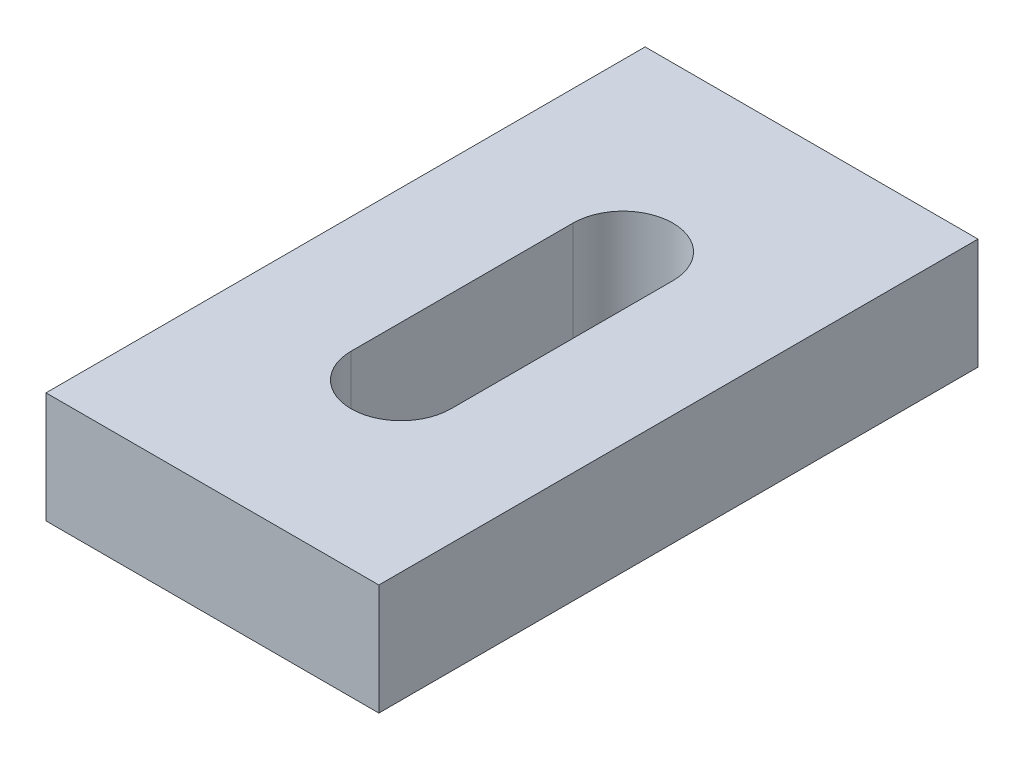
ISO-10303-21;
HEADER;
FILE_DESCRIPTION(('STEP AP214'),'2;1');
FILE_NAME('part.step','',(''),(''),'','','');
FILE_SCHEMA(('AUTOMOTIVE_DESIGN { 1 0 10303 214 1 1 1 1 }'));
ENDSEC;
DATA;
#1=APPLICATION_CONTEXT('core data for automotive mechanical design processes');
#2=APPLICATION_PROTOCOL_DEFINITION('international standard','automotive_design',2000,#1);
#3=PRODUCT_CONTEXT('',#1,'mechanical');
#4=PRODUCT('Part','Part','',(#3));
#5=PRODUCT_RELATED_PRODUCT_CATEGORY('part','',(#4));
#6=PRODUCT_DEFINITION_FORMATION('','',#4);
#7=PRODUCT_DEFINITION_CONTEXT('part definition',#1,'design');
#8=PRODUCT_DEFINITION('design','',#6,#7);
#9=PRODUCT_DEFINITION_SHAPE('','',#8);
#10=(LENGTH_UNIT() NAMED_UNIT(*) SI_UNIT(.MILLI.,.METRE.));
#11=(NAMED_UNIT(*) PLANE_ANGLE_UNIT() SI_UNIT($,.RADIAN.));
#12=(NAMED_UNIT(*) SI_UNIT($,.STERADIAN.) SOLID_ANGLE_UNIT());
#13=UNCERTAINTY_MEASURE_WITH_UNIT(LENGTH_MEASURE(1.E-05),#10,'distance_accuracy_value','');
#14=(GEOMETRIC_REPRESENTATION_CONTEXT(3) GLOBAL_UNCERTAINTY_ASSIGNED_CONTEXT((#13)) GLOBAL_UNIT_ASSIGNED_CONTEXT((#10,
#11,#12)) REPRESENTATION_CONTEXT('',''));
#15=CARTESIAN_POINT('',(0.,0.,0.));
#16=DIRECTION('',(0.,0.,1.));
#17=DIRECTION('',(1.,0.,0.));
#18=AXIS2_PLACEMENT_3D('',#15,#16,#17);
#19=CARTESIAN_POINT('',(0.,0.,0.));
#20=DIRECTION('',(0.,1.,0.));
#21=DIRECTION('',(0.,0.,1.));
#22=AXIS2_PLACEMENT_3D('',#19,#20,#21);
#23=PLANE('',#22);
#24=DIRECTION('',(-1.,0.,0.));
#25=VECTOR('',#24,1.);
#26=CARTESIAN_POINT('',(-7.5,0.,13.5));
#27=LINE('',#26,#25);
#28=CARTESIAN_POINT('',(7.5,0.,13.5));
#29=VERTEX_POINT('',#28);
#30=CARTESIAN_POINT('',(-7.5,0.,13.5));
#31=VERTEX_POINT('',#30);
#32=EDGE_CURVE('E113',#29,#31,#27,.T.);
#33=ORIENTED_EDGE('',*,*,#32,.T.);
#34=DIRECTION('',(0.,0.,-1.));
#35=VECTOR('',#34,1.);
#36=CARTESIAN_POINT('',(-7.5,0.,-13.5));
#37=LINE('',#36,#35);
#38=CARTESIAN_POINT('',(-7.5,0.,-13.5));
#39=VERTEX_POINT('',#38);
#40=EDGE_CURVE('E128',#31,#39,#37,.T.);
#41=ORIENTED_EDGE('',*,*,#40,.T.);
#42=DIRECTION('',(1.,0.,0.));
#43=VECTOR('',#42,1.);
#44=CARTESIAN_POINT('',(-7.5,0.,-13.5));
#45=LINE('',#44,#43);
#46=CARTESIAN_POINT('',(7.5,0.,-13.5));
#47=VERTEX_POINT('',#46);
#48=EDGE_CURVE('E132',#39,#47,#45,.T.);
#49=ORIENTED_EDGE('',*,*,#48,.T.);
#50=DIRECTION('',(0.,0.,1.));
#51=VECTOR('',#50,1.);
#52=CARTESIAN_POINT('',(7.5,0.,-13.5));
#53=LINE('',#52,#51);
#54=EDGE_CURVE('E91',#47,#29,#53,.T.);
#55=ORIENTED_EDGE('',*,*,#54,.T.);
#56=EDGE_LOOP('',(#33,#41,#49,#55));
#57=FACE_BOUND('',#56,.T.);
#58=DIRECTION('',(0.,0.,1.));
#59=VECTOR('',#58,1.);
#60=CARTESIAN_POINT('',(-2.25,0.,5.));
#61=LINE('',#60,#59);
#62=CARTESIAN_POINT('',(-2.25,0.,-5.));
#63=VERTEX_POINT('',#62);
#64=CARTESIAN_POINT('',(-2.25,0.,5.));
#65=VERTEX_POINT('',#64);
#66=EDGE_CURVE('E92',#63,#65,#61,.T.);
#67=ORIENTED_EDGE('',*,*,#66,.T.);
#68=CARTESIAN_POINT('',(0.,0.,5.));
#69=DIRECTION('',(0.,1.,0.));
#70=DIRECTION('',(0.,0.,1.));
#71=AXIS2_PLACEMENT_3D('',#68,#69,#70);
#72=CIRCLE('',#71,2.25);
#73=CARTESIAN_POINT('',(2.25,0.,5.));
#74=VERTEX_POINT('',#73);
#75=EDGE_CURVE('E84',#65,#74,#72,.T.);
#76=ORIENTED_EDGE('',*,*,#75,.T.);
#77=DIRECTION('',(0.,0.,-1.));
#78=VECTOR('',#77,1.);
#79=CARTESIAN_POINT('',(2.25,0.,5.));
#80=LINE('',#79,#78);
#81=CARTESIAN_POINT('',(2.25,0.,-5.));
#82=VERTEX_POINT('',#81);
#83=EDGE_CURVE('E105',#74,#82,#80,.T.);
#84=ORIENTED_EDGE('',*,*,#83,.T.);
#85=CARTESIAN_POINT('',(0.,0.,-5.));
#86=DIRECTION('',(0.,1.,0.));
#87=DIRECTION('',(0.,0.,1.));
#88=AXIS2_PLACEMENT_3D('',#85,#86,#87);
#89=CIRCLE('',#88,2.25);
#90=EDGE_CURVE('E20',#82,#63,#89,.T.);
#91=ORIENTED_EDGE('',*,*,#90,.T.);
#92=EDGE_LOOP('',(#67,#76,#84,#91));
#93=FACE_BOUND('',#92,.T.);
#94=ADVANCED_FACE('F17',(#57,#93),#23,.F.);
#95=CARTESIAN_POINT('',(-2.25,0.,5.));
#96=DIRECTION('',(-1.,0.,0.));
#97=DIRECTION('',(0.,0.,1.));
#98=AXIS2_PLACEMENT_3D('',#95,#96,#97);
#99=PLANE('',#98);
#100=DIRECTION('',(0.,1.,0.));
#101=VECTOR('',#100,1.);
#102=CARTESIAN_POINT('',(-2.25,0.,5.));
#103=LINE('',#102,#101);
#104=CARTESIAN_POINT('',(-2.25,5.,5.));
#105=VERTEX_POINT('',#104);
#106=EDGE_CURVE('E87',#65,#105,#103,.T.);
#107=ORIENTED_EDGE('',*,*,#106,.F.);
#108=ORIENTED_EDGE('',*,*,#66,.F.);
#109=DIRECTION('',(0.,1.,0.));
#110=VECTOR('',#109,1.);
#111=CARTESIAN_POINT('',(-2.25,0.,-5.));
#112=LINE('',#111,#110);
#113=CARTESIAN_POINT('',(-2.25,5.,-5.));
#114=VERTEX_POINT('',#113);
#115=EDGE_CURVE('E101',#63,#114,#112,.T.);
#116=ORIENTED_EDGE('',*,*,#115,.T.);
#117=DIRECTION('',(0.,0.,1.));
#118=VECTOR('',#117,1.);
#119=CARTESIAN_POINT('',(-2.25,5.,0.));
#120=LINE('',#119,#118);
#121=EDGE_CURVE('E98',#105,#114,#120,.F.);
#122=ORIENTED_EDGE('',*,*,#121,.F.);
#123=EDGE_LOOP('',(#107,#108,#116,#122));
#124=FACE_BOUND('',#123,.T.);
#125=ADVANCED_FACE('F96',(#124),#99,.F.);
#126=CARTESIAN_POINT('',(0.,0.,-5.));
#127=DIRECTION('',(0.,1.,0.));
#128=DIRECTION('',(0.,0.,1.));
#129=AXIS2_PLACEMENT_3D('',#126,#127,#128);
#130=CYLINDRICAL_SURFACE('',#129,2.25);
#131=ORIENTED_EDGE('',*,*,#115,.F.);
#132=ORIENTED_EDGE('',*,*,#90,.F.);
#133=DIRECTION('',(0.,1.,0.));
#134=VECTOR('',#133,1.);
#135=CARTESIAN_POINT('',(2.25,0.,-5.));
#136=LINE('',#135,#134);
#137=CARTESIAN_POINT('',(2.25,5.,-5.));
#138=VERTEX_POINT('',#137);
#139=EDGE_CURVE('E106',#82,#138,#136,.T.);
#140=ORIENTED_EDGE('',*,*,#139,.T.);
#141=CARTESIAN_POINT('',(0.,5.,-5.));
#142=DIRECTION('',(0.,1.,0.));
#143=DIRECTION('',(0.,0.,1.));
#144=AXIS2_PLACEMENT_3D('',#141,#142,#143);
#145=CIRCLE('',#144,2.25);
#146=EDGE_CURVE('E108',#114,#138,#145,.F.);
#147=ORIENTED_EDGE('',*,*,#146,.F.);
#148=EDGE_LOOP('',(#131,#132,#140,#147));
#149=FACE_BOUND('',#148,.T.);
#150=ADVANCED_FACE('F142',(#149),#130,.F.);
#151=CARTESIAN_POINT('',(2.25,0.,5.));
#152=DIRECTION('',(1.,0.,0.));
#153=DIRECTION('',(0.,0.,-1.));
#154=AXIS2_PLACEMENT_3D('',#151,#152,#153);
#155=PLANE('',#154);
#156=ORIENTED_EDGE('',*,*,#139,.F.);
#157=ORIENTED_EDGE('',*,*,#83,.F.);
#158=DIRECTION('',(0.,1.,0.));
#159=VECTOR('',#158,1.);
#160=CARTESIAN_POINT('',(2.25,0.,5.));
#161=LINE('',#160,#159);
#162=CARTESIAN_POINT('',(2.25,5.,5.));
#163=VERTEX_POINT('',#162);
#164=EDGE_CURVE('E90',#74,#163,#161,.T.);
#165=ORIENTED_EDGE('',*,*,#164,.T.);
#166=DIRECTION('',(0.,0.,1.));
#167=VECTOR('',#166,1.);
#168=CARTESIAN_POINT('',(2.25,5.,0.));
#169=LINE('',#168,#167);
#170=EDGE_CURVE('E111',#138,#163,#169,.T.);
#171=ORIENTED_EDGE('',*,*,#170,.F.);
#172=EDGE_LOOP('',(#156,#157,#165,#171));
#173=FACE_BOUND('',#172,.T.);
#174=ADVANCED_FACE('F144',(#173),#155,.F.);
#175=CARTESIAN_POINT('',(0.,0.,5.));
#176=DIRECTION('',(0.,1.,0.));
#177=DIRECTION('',(0.,0.,1.));
#178=AXIS2_PLACEMENT_3D('',#175,#176,#177);
#179=CYLINDRICAL_SURFACE('',#178,2.25);
#180=ORIENTED_EDGE('',*,*,#75,.F.);
#181=ORIENTED_EDGE('',*,*,#106,.T.);
#182=CARTESIAN_POINT('',(0.,5.,5.));
#183=DIRECTION('',(0.,1.,0.));
#184=DIRECTION('',(0.,0.,1.));
#185=AXIS2_PLACEMENT_3D('',#182,#183,#184);
#186=CIRCLE('',#185,2.25);
#187=EDGE_CURVE('E112',#163,#105,#186,.F.);
#188=ORIENTED_EDGE('',*,*,#187,.F.);
#189=ORIENTED_EDGE('',*,*,#164,.F.);
#190=EDGE_LOOP('',(#180,#181,#188,#189));
#191=FACE_BOUND('',#190,.T.);
#192=ADVANCED_FACE('F85',(#191),#179,.F.);
#193=CARTESIAN_POINT('',(7.5,5.,-13.5));
#194=DIRECTION('',(-1.,0.,0.));
#195=DIRECTION('',(0.,0.,1.));
#196=AXIS2_PLACEMENT_3D('',#193,#194,#195);
#197=PLANE('',#196);
#198=DIRECTION('',(0.,1.,0.));
#199=VECTOR('',#198,1.);
#200=CARTESIAN_POINT('',(7.5,5.,-13.5));
#201=LINE('',#200,#199);
#202=CARTESIAN_POINT('',(7.5,5.,-13.5));
#203=VERTEX_POINT('',#202);
#204=EDGE_CURVE('E135',#47,#203,#201,.T.);
#205=ORIENTED_EDGE('',*,*,#204,.T.);
#206=DIRECTION('',(0.,0.,1.));
#207=VECTOR('',#206,1.);
#208=CARTESIAN_POINT('',(7.5,5.,0.));
#209=LINE('',#208,#207);
#210=CARTESIAN_POINT('',(7.5,5.,13.5));
#211=VERTEX_POINT('',#210);
#212=EDGE_CURVE('E145',#211,#203,#209,.F.);
#213=ORIENTED_EDGE('',*,*,#212,.F.);
#214=DIRECTION('',(0.,1.,0.));
#215=VECTOR('',#214,1.);
#216=CARTESIAN_POINT('',(7.5,5.,13.5));
#217=LINE('',#216,#215);
#218=EDGE_CURVE('E118',#211,#29,#217,.F.);
#219=ORIENTED_EDGE('',*,*,#218,.T.);
#220=ORIENTED_EDGE('',*,*,#54,.F.);
#221=EDGE_LOOP('',(#205,#213,#219,#220));
#222=FACE_BOUND('',#221,.T.);
#223=ADVANCED_FACE('F165',(#222),#197,.F.);
#224=CARTESIAN_POINT('',(-7.5,5.,-13.5));
#225=DIRECTION('',(0.,0.,1.));
#226=DIRECTION('',(1.,0.,0.));
#227=AXIS2_PLACEMENT_3D('',#224,#225,#226);
#228=PLANE('',#227);
#229=DIRECTION('',(0.,1.,0.));
#230=VECTOR('',#229,1.);
#231=CARTESIAN_POINT('',(-7.5,5.,-13.5));
#232=LINE('',#231,#230);
#233=CARTESIAN_POINT('',(-7.5,5.,-13.5));
#234=VERTEX_POINT('',#233);
#235=EDGE_CURVE('E130',#39,#234,#232,.T.);
#236=ORIENTED_EDGE('',*,*,#235,.T.);
#237=DIRECTION('',(1.,0.,0.));
#238=VECTOR('',#237,1.);
#239=CARTESIAN_POINT('',(0.,5.,-13.5));
#240=LINE('',#239,#238);
#241=EDGE_CURVE('E247',#203,#234,#240,.F.);
#242=ORIENTED_EDGE('',*,*,#241,.F.);
#243=ORIENTED_EDGE('',*,*,#204,.F.);
#244=ORIENTED_EDGE('',*,*,#48,.F.);
#245=EDGE_LOOP('',(#236,#242,#243,#244));
#246=FACE_BOUND('',#245,.T.);
#247=ADVANCED_FACE('F162',(#246),#228,.F.);
#248=CARTESIAN_POINT('',(-7.5,5.,-13.5));
#249=DIRECTION('',(1.,0.,0.));
#250=DIRECTION('',(0.,0.,-1.));
#251=AXIS2_PLACEMENT_3D('',#248,#249,#250);
#252=PLANE('',#251);
#253=DIRECTION('',(0.,1.,0.));
#254=VECTOR('',#253,1.);
#255=CARTESIAN_POINT('',(-7.5,5.,13.5));
#256=LINE('',#255,#254);
#257=CARTESIAN_POINT('',(-7.5,5.,13.5));
#258=VERTEX_POINT('',#257);
#259=EDGE_CURVE('E35',#31,#258,#256,.T.);
#260=ORIENTED_EDGE('',*,*,#259,.T.);
#261=DIRECTION('',(0.,0.,1.));
#262=VECTOR('',#261,1.);
#263=CARTESIAN_POINT('',(-7.5,5.,0.));
#264=LINE('',#263,#262);
#265=EDGE_CURVE('E26',#234,#258,#264,.T.);
#266=ORIENTED_EDGE('',*,*,#265,.F.);
#267=ORIENTED_EDGE('',*,*,#235,.F.);
#268=ORIENTED_EDGE('',*,*,#40,.F.);
#269=EDGE_LOOP('',(#260,#266,#267,#268));
#270=FACE_BOUND('',#269,.T.);
#271=ADVANCED_FACE('F155',(#270),#252,.F.);
#272=CARTESIAN_POINT('',(-7.5,5.,13.5));
#273=DIRECTION('',(0.,0.,-1.));
#274=DIRECTION('',(-1.,0.,0.));
#275=AXIS2_PLACEMENT_3D('',#272,#273,#274);
#276=PLANE('',#275);
#277=ORIENTED_EDGE('',*,*,#218,.F.);
#278=DIRECTION('',(1.,0.,0.));
#279=VECTOR('',#278,1.);
#280=CARTESIAN_POINT('',(0.,5.,13.5));
#281=LINE('',#280,#279);
#282=EDGE_CURVE('E11',#258,#211,#281,.T.);
#283=ORIENTED_EDGE('',*,*,#282,.F.);
#284=ORIENTED_EDGE('',*,*,#259,.F.);
#285=ORIENTED_EDGE('',*,*,#32,.F.);
#286=EDGE_LOOP('',(#277,#283,#284,#285));
#287=FACE_BOUND('',#286,.T.);
#288=ADVANCED_FACE('F148',(#287),#276,.F.);
#289=CARTESIAN_POINT('',(0.,5.,0.));
#290=DIRECTION('',(0.,1.,0.));
#291=DIRECTION('',(0.,0.,1.));
#292=AXIS2_PLACEMENT_3D('',#289,#290,#291);
#293=PLANE('',#292);
#294=ORIENTED_EDGE('',*,*,#265,.T.);
#295=ORIENTED_EDGE('',*,*,#282,.T.);
#296=ORIENTED_EDGE('',*,*,#212,.T.);
#297=ORIENTED_EDGE('',*,*,#241,.T.);
#298=EDGE_LOOP('',(#294,#295,#296,#297));
#299=FACE_BOUND('',#298,.T.);
#300=ORIENTED_EDGE('',*,*,#170,.T.);
#301=ORIENTED_EDGE('',*,*,#187,.T.);
#302=ORIENTED_EDGE('',*,*,#121,.T.);
#303=ORIENTED_EDGE('',*,*,#146,.T.);
#304=EDGE_LOOP('',(#300,#301,#302,#303));
#305=FACE_BOUND('',#304,.T.);
#306=ADVANCED_FACE('F146',(#299,#305),#293,.T.);
#307=CLOSED_SHELL('',(#94,#125,#150,#174,#192,#223,#247,#271,#288,#306));
#308=MANIFOLD_SOLID_BREP('B1',#307);
#309=ADVANCED_BREP_SHAPE_REPRESENTATION('',(#18,#308),#14);
#310=SHAPE_DEFINITION_REPRESENTATION(#9,#309);
ENDSEC;
END-ISO-10303-21;
